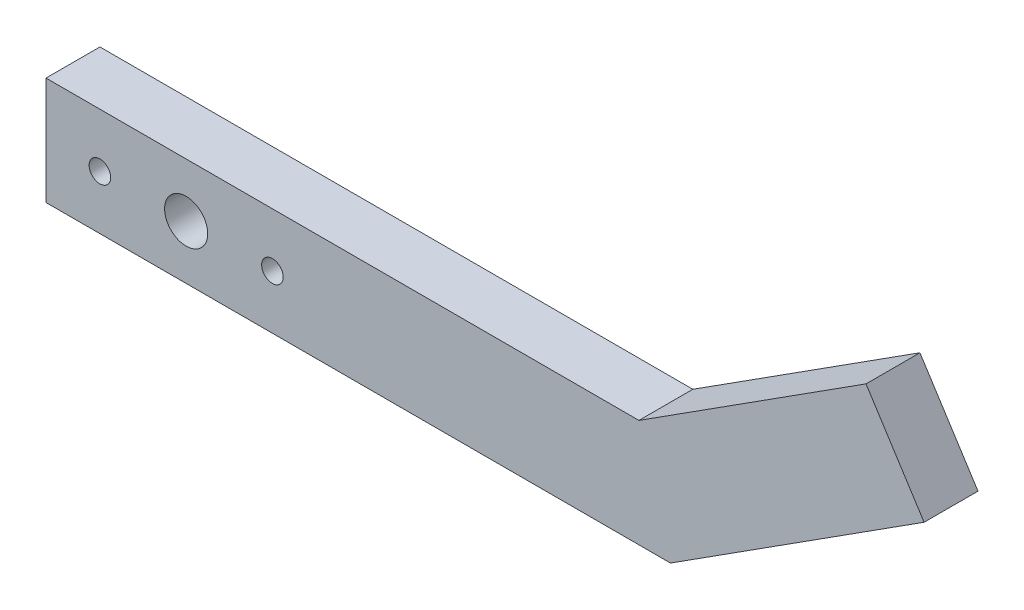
from build123d import *

# Parameters (mm, degrees)
BOSS_EXTRUDE1_DEPTH = 5
SKETCH2_R           = 2
SKETCH2_R_2         = 1
CUT_EXTRUDE1_DEPTH  = 5


with BuildPart() as part:
    # Sketch1 → Boss-Extrude1 (new body)
    with BuildSketch(Plane.XY):
        Polygon((25, 5), (46.063993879, 18.465071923), (51.450022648, 10.039474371), (27.923122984, -5), (20, -5), (-30, -5), (-30, 5), align=None)
    extrude(amount=BOSS_EXTRUDE1_DEPTH)

    # Sketch2 → Cut-Extrude1 (cut)
    with BuildSketch(Plane.XY.offset(5)):
        with Locations((-17, 0)):
            Circle(SKETCH2_R)
        with Locations((-25, 0)):
            Circle(SKETCH2_R_2)
        with Locations((-9, 0)):
            Circle(SKETCH2_R_2)
    extrude(amount=-CUT_EXTRUDE1_DEPTH, mode=Mode.SUBTRACT)


solid = part.part
